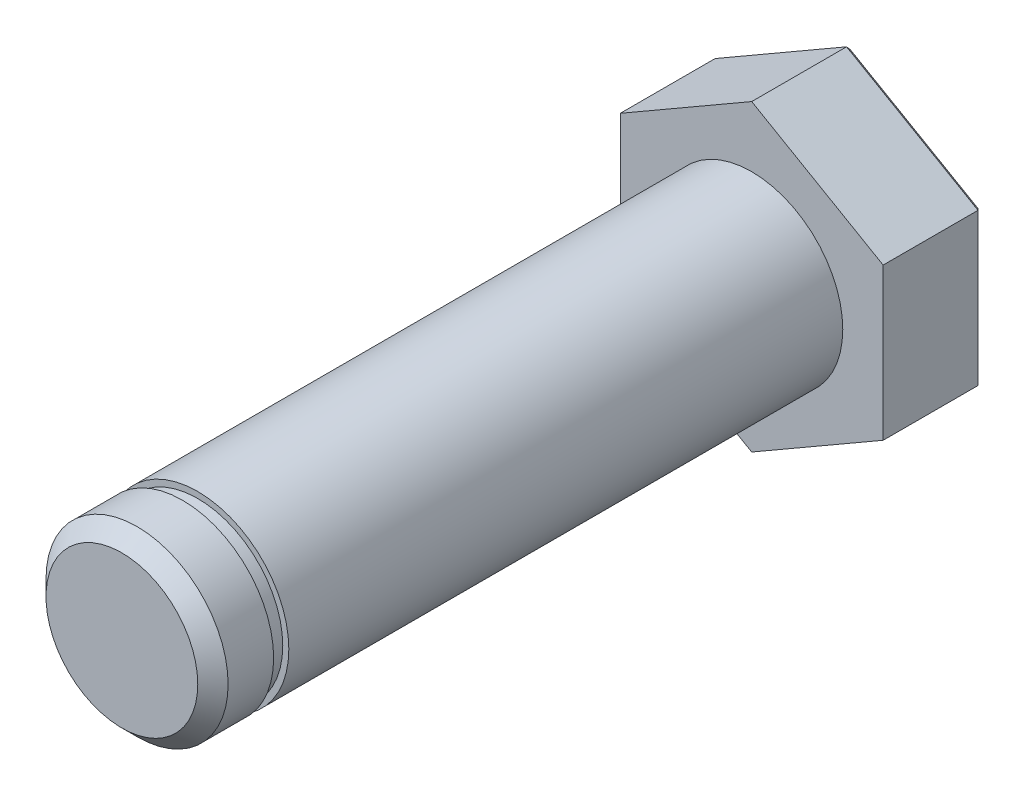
ISO-10303-21;
HEADER;
FILE_DESCRIPTION(('STEP AP214'),'2;1');
FILE_NAME('part.step','',(''),(''),'','','');
FILE_SCHEMA(('AUTOMOTIVE_DESIGN { 1 0 10303 214 1 1 1 1 }'));
ENDSEC;
DATA;
#1=APPLICATION_CONTEXT('core data for automotive mechanical design processes');
#2=APPLICATION_PROTOCOL_DEFINITION('international standard','automotive_design',2000,#1);
#3=PRODUCT_CONTEXT('',#1,'mechanical');
#4=PRODUCT('Part','Part','',(#3));
#5=PRODUCT_RELATED_PRODUCT_CATEGORY('part','',(#4));
#6=PRODUCT_DEFINITION_FORMATION('','',#4);
#7=PRODUCT_DEFINITION_CONTEXT('part definition',#1,'design');
#8=PRODUCT_DEFINITION('design','',#6,#7);
#9=PRODUCT_DEFINITION_SHAPE('','',#8);
#10=(LENGTH_UNIT() NAMED_UNIT(*) SI_UNIT(.MILLI.,.METRE.));
#11=(NAMED_UNIT(*) PLANE_ANGLE_UNIT() SI_UNIT($,.RADIAN.));
#12=(NAMED_UNIT(*) SI_UNIT($,.STERADIAN.) SOLID_ANGLE_UNIT());
#13=UNCERTAINTY_MEASURE_WITH_UNIT(LENGTH_MEASURE(1.E-05),#10,'distance_accuracy_value','');
#14=(GEOMETRIC_REPRESENTATION_CONTEXT(3) GLOBAL_UNCERTAINTY_ASSIGNED_CONTEXT((#13)) GLOBAL_UNIT_ASSIGNED_CONTEXT((#10,
#11,#12)) REPRESENTATION_CONTEXT('',''));
#15=CARTESIAN_POINT('',(0.,0.,0.));
#16=DIRECTION('',(0.,0.,1.));
#17=DIRECTION('',(1.,0.,0.));
#18=AXIS2_PLACEMENT_3D('',#15,#16,#17);
#19=CARTESIAN_POINT('',(0.,0.,36.5));
#20=DIRECTION('',(0.,0.,1.));
#21=DIRECTION('',(1.,0.,0.));
#22=AXIS2_PLACEMENT_3D('',#19,#20,#21);
#23=PLANE('',#22);
#24=CARTESIAN_POINT('',(0.,0.,36.5));
#25=DIRECTION('',(0.,0.,1.));
#26=DIRECTION('',(1.,0.,0.));
#27=AXIS2_PLACEMENT_3D('',#24,#25,#26);
#28=CIRCLE('',#27,6.);
#29=CARTESIAN_POINT('',(6.,0.,36.5));
#30=VERTEX_POINT('',#29);
#31=EDGE_CURVE('E161',#30,#30,#28,.T.);
#32=ORIENTED_EDGE('',*,*,#31,.T.);
#33=EDGE_LOOP('',(#32));
#34=FACE_BOUND('',#33,.T.);
#35=CARTESIAN_POINT('',(0.,0.,36.5));
#36=DIRECTION('',(0.,0.,1.));
#37=DIRECTION('',(1.,0.,0.));
#38=AXIS2_PLACEMENT_3D('',#35,#36,#37);
#39=CIRCLE('',#38,5.6);
#40=CARTESIAN_POINT('',(5.6,0.,36.5));
#41=VERTEX_POINT('',#40);
#42=EDGE_CURVE('E138',#41,#41,#39,.T.);
#43=ORIENTED_EDGE('',*,*,#42,.F.);
#44=EDGE_LOOP('',(#43));
#45=FACE_BOUND('',#44,.T.);
#46=ADVANCED_FACE('F35',(#34,#45),#23,.T.);
#47=CARTESIAN_POINT('',(0.,0.,36.5));
#48=DIRECTION('',(0.,0.,-1.));
#49=DIRECTION('',(-1.,0.,0.));
#50=AXIS2_PLACEMENT_3D('',#47,#48,#49);
#51=CYLINDRICAL_SURFACE('',#50,6.);
#52=ORIENTED_EDGE('',*,*,#31,.F.);
#53=EDGE_LOOP('',(#52));
#54=FACE_BOUND('',#53,.T.);
#55=CARTESIAN_POINT('',(0.,0.,0.));
#56=DIRECTION('',(0.,0.,-1.));
#57=DIRECTION('',(-1.,0.,0.));
#58=AXIS2_PLACEMENT_3D('',#55,#56,#57);
#59=CIRCLE('',#58,6.);
#60=CARTESIAN_POINT('',(-6.,0.,0.));
#61=VERTEX_POINT('',#60);
#62=EDGE_CURVE('E118',#61,#61,#59,.T.);
#63=ORIENTED_EDGE('',*,*,#62,.F.);
#64=EDGE_LOOP('',(#63));
#65=FACE_BOUND('',#64,.T.);
#66=ADVANCED_FACE('F37',(#54,#65),#51,.T.);
#67=CARTESIAN_POINT('',(-8.66025403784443,-15.,0.));
#68=DIRECTION('',(0.,0.,-1.));
#69=DIRECTION('',(-1.,0.,0.));
#70=AXIS2_PLACEMENT_3D('',#67,#68,#69);
#71=PLANE('',#70);
#72=DIRECTION('',(-0.866025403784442,-0.499999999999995,0.));
#73=VECTOR('',#72,1.);
#74=CARTESIAN_POINT('',(8.66025403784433,-5.0000000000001,0.));
#75=LINE('',#74,#73);
#76=CARTESIAN_POINT('',(8.66025403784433,-5.0000000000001,0.));
#77=VERTEX_POINT('',#76);
#78=CARTESIAN_POINT('',(0.,-10.,0.));
#79=VERTEX_POINT('',#78);
#80=EDGE_CURVE('E126',#77,#79,#75,.T.);
#81=ORIENTED_EDGE('',*,*,#80,.F.);
#82=DIRECTION('',(0.,-1.,0.));
#83=VECTOR('',#82,1.);
#84=CARTESIAN_POINT('',(8.66025403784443,4.99999999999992,0.));
#85=LINE('',#84,#83);
#86=CARTESIAN_POINT('',(8.66025403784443,4.99999999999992,0.));
#87=VERTEX_POINT('',#86);
#88=EDGE_CURVE('E149',#87,#77,#85,.T.);
#89=ORIENTED_EDGE('',*,*,#88,.F.);
#90=DIRECTION('',(0.866025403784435,-0.500000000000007,0.));
#91=VECTOR('',#90,1.);
#92=CARTESIAN_POINT('',(0.,10.,0.));
#93=LINE('',#92,#91);
#94=CARTESIAN_POINT('',(0.,10.,0.));
#95=VERTEX_POINT('',#94);
#96=EDGE_CURVE('E146',#95,#87,#93,.T.);
#97=ORIENTED_EDGE('',*,*,#96,.F.);
#98=DIRECTION('',(0.866025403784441,0.499999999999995,0.));
#99=VECTOR('',#98,1.);
#100=CARTESIAN_POINT('',(-8.66025403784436,5.00000000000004,0.));
#101=LINE('',#100,#99);
#102=CARTESIAN_POINT('',(-8.66025403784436,5.00000000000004,0.));
#103=VERTEX_POINT('',#102);
#104=EDGE_CURVE('E143',#103,#95,#101,.T.);
#105=ORIENTED_EDGE('',*,*,#104,.F.);
#106=DIRECTION('',(0.,1.,0.));
#107=VECTOR('',#106,1.);
#108=CARTESIAN_POINT('',(-8.6602540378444,-4.99999999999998,0.));
#109=LINE('',#108,#107);
#110=CARTESIAN_POINT('',(-8.6602540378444,-4.99999999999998,0.));
#111=VERTEX_POINT('',#110);
#112=EDGE_CURVE('E129',#111,#103,#109,.T.);
#113=ORIENTED_EDGE('',*,*,#112,.F.);
#114=DIRECTION('',(-0.866025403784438,0.500000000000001,0.));
#115=VECTOR('',#114,1.);
#116=CARTESIAN_POINT('',(0.,-10.,0.));
#117=LINE('',#116,#115);
#118=EDGE_CURVE('E113',#79,#111,#117,.T.);
#119=ORIENTED_EDGE('',*,*,#118,.F.);
#120=EDGE_LOOP('',(#81,#89,#97,#105,#113,#119));
#121=FACE_BOUND('',#120,.T.);
#122=ORIENTED_EDGE('',*,*,#62,.T.);
#123=EDGE_LOOP('',(#122));
#124=FACE_BOUND('',#123,.T.);
#125=ADVANCED_FACE('F123',(#121,#124),#71,.F.);
#126=CARTESIAN_POINT('',(8.66025403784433,-5.0000000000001,-6.5));
#127=DIRECTION('',(-0.499999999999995,0.866025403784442,0.));
#128=DIRECTION('',(-0.866025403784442,-0.499999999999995,0.));
#129=AXIS2_PLACEMENT_3D('',#126,#127,#128);
#130=PLANE('',#129);
#131=DIRECTION('',(0.,0.,1.));
#132=VECTOR('',#131,1.);
#133=CARTESIAN_POINT('',(0.,-10.,-6.5));
#134=LINE('',#133,#132);
#135=CARTESIAN_POINT('',(0.,-10.,-6.25));
#136=VERTEX_POINT('',#135);
#137=EDGE_CURVE('E109',#136,#79,#134,.T.);
#138=ORIENTED_EDGE('',*,*,#137,.F.);
#139=DIRECTION('',(0.866025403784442,0.499999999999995,0.));
#140=VECTOR('',#139,1.);
#141=CARTESIAN_POINT('',(8.41025403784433,-5.14433756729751,-6.25));
#142=LINE('',#141,#140);
#143=CARTESIAN_POINT('',(8.66025403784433,-5.0000000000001,-6.25));
#144=VERTEX_POINT('',#143);
#145=EDGE_CURVE('E193',#136,#144,#142,.T.);
#146=ORIENTED_EDGE('',*,*,#145,.T.);
#147=DIRECTION('',(0.,0.,1.));
#148=VECTOR('',#147,1.);
#149=CARTESIAN_POINT('',(8.66025403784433,-5.0000000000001,-6.5));
#150=LINE('',#149,#148);
#151=EDGE_CURVE('E133',#144,#77,#150,.T.);
#152=ORIENTED_EDGE('',*,*,#151,.T.);
#153=ORIENTED_EDGE('',*,*,#80,.T.);
#154=EDGE_LOOP('',(#138,#146,#152,#153));
#155=FACE_BOUND('',#154,.T.);
#156=ADVANCED_FACE('F131',(#155),#130,.F.);
#157=CARTESIAN_POINT('',(0.,-10.,-6.5));
#158=DIRECTION('',(0.500000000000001,0.866025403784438,0.));
#159=DIRECTION('',(-0.866025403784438,0.500000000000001,0.));
#160=AXIS2_PLACEMENT_3D('',#157,#158,#159);
#161=PLANE('',#160);
#162=DIRECTION('',(0.,0.,1.));
#163=VECTOR('',#162,1.);
#164=CARTESIAN_POINT('',(-8.6602540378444,-4.99999999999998,-6.5));
#165=LINE('',#164,#163);
#166=CARTESIAN_POINT('',(-8.6602540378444,-4.99999999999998,-6.25));
#167=VERTEX_POINT('',#166);
#168=EDGE_CURVE('E119',#167,#111,#165,.T.);
#169=ORIENTED_EDGE('',*,*,#168,.F.);
#170=DIRECTION('',(0.866025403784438,-0.500000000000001,0.));
#171=VECTOR('',#170,1.);
#172=CARTESIAN_POINT('',(-0.249999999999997,-9.8556624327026,-6.25));
#173=LINE('',#172,#171);
#174=EDGE_CURVE('E115',#167,#136,#173,.T.);
#175=ORIENTED_EDGE('',*,*,#174,.T.);
#176=ORIENTED_EDGE('',*,*,#137,.T.);
#177=ORIENTED_EDGE('',*,*,#118,.T.);
#178=EDGE_LOOP('',(#169,#175,#176,#177));
#179=FACE_BOUND('',#178,.T.);
#180=ADVANCED_FACE('F112',(#179),#161,.F.);
#181=CARTESIAN_POINT('',(-8.6602540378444,-4.99999999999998,-6.5));
#182=DIRECTION('',(1.,0.,0.));
#183=DIRECTION('',(0.,1.,0.));
#184=AXIS2_PLACEMENT_3D('',#181,#182,#183);
#185=PLANE('',#184);
#186=DIRECTION('',(0.,0.,1.));
#187=VECTOR('',#186,1.);
#188=CARTESIAN_POINT('',(-8.66025403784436,5.00000000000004,-6.5));
#189=LINE('',#188,#187);
#190=CARTESIAN_POINT('',(-8.66025403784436,5.00000000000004,-6.25));
#191=VERTEX_POINT('',#190);
#192=EDGE_CURVE('E156',#191,#103,#189,.T.);
#193=ORIENTED_EDGE('',*,*,#192,.F.);
#194=DIRECTION('',(0.,-1.,0.));
#195=VECTOR('',#194,1.);
#196=CARTESIAN_POINT('',(-8.6602540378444,-4.99999999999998,-6.25));
#197=LINE('',#196,#195);
#198=EDGE_CURVE('E181',#191,#167,#197,.T.);
#199=ORIENTED_EDGE('',*,*,#198,.T.);
#200=ORIENTED_EDGE('',*,*,#168,.T.);
#201=ORIENTED_EDGE('',*,*,#112,.T.);
#202=EDGE_LOOP('',(#193,#199,#200,#201));
#203=FACE_BOUND('',#202,.T.);
#204=ADVANCED_FACE('F229',(#203),#185,.F.);
#205=CARTESIAN_POINT('',(-8.66025403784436,5.00000000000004,-6.5));
#206=DIRECTION('',(0.499999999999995,-0.866025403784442,0.));
#207=DIRECTION('',(0.866025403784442,0.499999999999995,0.));
#208=AXIS2_PLACEMENT_3D('',#205,#206,#207);
#209=PLANE('',#208);
#210=DIRECTION('',(0.,0.,1.));
#211=VECTOR('',#210,1.);
#212=CARTESIAN_POINT('',(0.,10.,-6.5));
#213=LINE('',#212,#211);
#214=CARTESIAN_POINT('',(0.,10.,-6.25));
#215=VERTEX_POINT('',#214);
#216=EDGE_CURVE('E154',#215,#95,#213,.T.);
#217=ORIENTED_EDGE('',*,*,#216,.F.);
#218=DIRECTION('',(-0.866025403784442,-0.499999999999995,0.));
#219=VECTOR('',#218,1.);
#220=CARTESIAN_POINT('',(-8.66025403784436,5.00000000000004,-6.25));
#221=LINE('',#220,#219);
#222=EDGE_CURVE('E174',#215,#191,#221,.T.);
#223=ORIENTED_EDGE('',*,*,#222,.T.);
#224=ORIENTED_EDGE('',*,*,#192,.T.);
#225=ORIENTED_EDGE('',*,*,#104,.T.);
#226=EDGE_LOOP('',(#217,#223,#224,#225));
#227=FACE_BOUND('',#226,.T.);
#228=ADVANCED_FACE('F232',(#227),#209,.F.);
#229=CARTESIAN_POINT('',(0.,10.,-6.5));
#230=DIRECTION('',(-0.500000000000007,-0.866025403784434,0.));
#231=DIRECTION('',(0.866025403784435,-0.500000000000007,0.));
#232=AXIS2_PLACEMENT_3D('',#229,#230,#231);
#233=PLANE('',#232);
#234=DIRECTION('',(0.,0.,1.));
#235=VECTOR('',#234,1.);
#236=CARTESIAN_POINT('',(8.66025403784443,4.99999999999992,-6.5));
#237=LINE('',#236,#235);
#238=CARTESIAN_POINT('',(8.66025403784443,4.99999999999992,-6.25));
#239=VERTEX_POINT('',#238);
#240=EDGE_CURVE('E152',#239,#87,#237,.T.);
#241=ORIENTED_EDGE('',*,*,#240,.F.);
#242=DIRECTION('',(-0.866025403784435,0.500000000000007,0.));
#243=VECTOR('',#242,1.);
#244=CARTESIAN_POINT('',(0.,10.,-6.25));
#245=LINE('',#244,#243);
#246=EDGE_CURVE('E167',#239,#215,#245,.T.);
#247=ORIENTED_EDGE('',*,*,#246,.T.);
#248=ORIENTED_EDGE('',*,*,#216,.T.);
#249=ORIENTED_EDGE('',*,*,#96,.T.);
#250=EDGE_LOOP('',(#241,#247,#248,#249));
#251=FACE_BOUND('',#250,.T.);
#252=ADVANCED_FACE('F236',(#251),#233,.F.);
#253=CARTESIAN_POINT('',(8.66025403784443,4.99999999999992,-6.5));
#254=DIRECTION('',(-1.,0.,0.));
#255=DIRECTION('',(0.,-1.,0.));
#256=AXIS2_PLACEMENT_3D('',#253,#254,#255);
#257=PLANE('',#256);
#258=ORIENTED_EDGE('',*,*,#151,.F.);
#259=DIRECTION('',(0.,1.,0.));
#260=VECTOR('',#259,1.);
#261=CARTESIAN_POINT('',(8.66025403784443,4.71132486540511,-6.25));
#262=LINE('',#261,#260);
#263=EDGE_CURVE('E187',#144,#239,#262,.T.);
#264=ORIENTED_EDGE('',*,*,#263,.T.);
#265=ORIENTED_EDGE('',*,*,#240,.T.);
#266=ORIENTED_EDGE('',*,*,#88,.T.);
#267=EDGE_LOOP('',(#258,#264,#265,#266));
#268=FACE_BOUND('',#267,.T.);
#269=ADVANCED_FACE('F240',(#268),#257,.F.);
#270=CARTESIAN_POINT('',(-8.66025403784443,-15.,-6.5));
#271=DIRECTION('',(0.,0.,-1.));
#272=DIRECTION('',(-1.,0.,0.));
#273=AXIS2_PLACEMENT_3D('',#270,#271,#272);
#274=PLANE('',#273);
#275=DIRECTION('',(-0.866025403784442,-0.499999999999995,0.));
#276=VECTOR('',#275,1.);
#277=CARTESIAN_POINT('',(-0.124999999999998,-9.78349364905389,-6.5));
#278=LINE('',#277,#276);
#279=CARTESIAN_POINT('',(8.41025403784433,-4.85566243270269,-6.5));
#280=VERTEX_POINT('',#279);
#281=CARTESIAN_POINT('',(0.,-9.71132486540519,-6.5));
#282=VERTEX_POINT('',#281);
#283=EDGE_CURVE('E191',#280,#282,#278,.T.);
#284=ORIENTED_EDGE('',*,*,#283,.T.);
#285=DIRECTION('',(-0.866025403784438,0.500000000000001,0.));
#286=VECTOR('',#285,1.);
#287=CARTESIAN_POINT('',(-8.2852540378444,-4.92783121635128,-6.5));
#288=LINE('',#287,#286);
#289=CARTESIAN_POINT('',(-8.4102540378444,-4.85566243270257,-6.5));
#290=VERTEX_POINT('',#289);
#291=EDGE_CURVE('E197',#282,#290,#288,.T.);
#292=ORIENTED_EDGE('',*,*,#291,.T.);
#293=DIRECTION('',(0.,1.,0.));
#294=VECTOR('',#293,1.);
#295=CARTESIAN_POINT('',(-8.41025403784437,4.71132486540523,-6.5));
#296=LINE('',#295,#294);
#297=CARTESIAN_POINT('',(-8.41025403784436,4.85566243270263,-6.5));
#298=VERTEX_POINT('',#297);
#299=EDGE_CURVE('E177',#290,#298,#296,.T.);
#300=ORIENTED_EDGE('',*,*,#299,.T.);
#301=DIRECTION('',(0.866025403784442,0.499999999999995,0.));
#302=VECTOR('',#301,1.);
#303=CARTESIAN_POINT('',(-0.124999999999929,9.63915608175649,-6.5));
#304=LINE('',#303,#302);
#305=CARTESIAN_POINT('',(0.,9.71132486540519,-6.5));
#306=VERTEX_POINT('',#305);
#307=EDGE_CURVE('E170',#298,#306,#304,.T.);
#308=ORIENTED_EDGE('',*,*,#307,.T.);
#309=DIRECTION('',(0.866025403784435,-0.500000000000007,0.));
#310=VECTOR('',#309,1.);
#311=CARTESIAN_POINT('',(8.53525403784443,4.78349364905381,-6.5));
#312=LINE('',#311,#310);
#313=CARTESIAN_POINT('',(8.41025403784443,4.85566243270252,-6.5));
#314=VERTEX_POINT('',#313);
#315=EDGE_CURVE('E164',#306,#314,#312,.T.);
#316=ORIENTED_EDGE('',*,*,#315,.T.);
#317=DIRECTION('',(0.,-1.,0.));
#318=VECTOR('',#317,1.);
#319=CARTESIAN_POINT('',(8.41025403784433,-5.0000000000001,-6.5));
#320=LINE('',#319,#318);
#321=EDGE_CURVE('E184',#314,#280,#320,.T.);
#322=ORIENTED_EDGE('',*,*,#321,.T.);
#323=EDGE_LOOP('',(#284,#292,#300,#308,#316,#322));
#324=FACE_BOUND('',#323,.T.);
#325=ADVANCED_FACE('F244',(#324),#274,.T.);
#326=CARTESIAN_POINT('',(4.20512701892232,7.28349364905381,-6.5));
#327=DIRECTION('',(0.35355339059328,0.612372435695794,-0.707106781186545));
#328=DIRECTION('',(0.,0.755928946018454,0.654653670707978));
#329=AXIS2_PLACEMENT_3D('',#326,#327,#328);
#330=PLANE('',#329);
#331=ORIENTED_EDGE('',*,*,#246,.F.);
#332=DIRECTION('',(-0.654653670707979,-0.37796447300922,-0.654653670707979));
#333=VECTOR('',#332,1.);
#334=CARTESIAN_POINT('',(7.20878917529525,4.16199637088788,-7.70146486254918));
#335=LINE('',#334,#333);
#336=EDGE_CURVE('E189',#239,#314,#335,.T.);
#337=ORIENTED_EDGE('',*,*,#336,.T.);
#338=ORIENTED_EDGE('',*,*,#315,.F.);
#339=DIRECTION('',(0.,0.755928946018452,0.654653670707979));
#340=VECTOR('',#339,1.);
#341=CARTESIAN_POINT('',(0.,8.32399274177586,-7.70146486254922));
#342=LINE('',#341,#340);
#343=EDGE_CURVE('E172',#306,#215,#342,.T.);
#344=ORIENTED_EDGE('',*,*,#343,.T.);
#345=EDGE_LOOP('',(#331,#337,#338,#344));
#346=FACE_BOUND('',#345,.T.);
#347=ADVANCED_FACE('F248',(#346),#330,.T.);
#348=CARTESIAN_POINT('',(-17.1955080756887,-0.216506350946,-6.5));
#349=DIRECTION('',(-0.353553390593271,0.612372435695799,-0.707106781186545));
#350=DIRECTION('',(0.,0.755928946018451,0.654653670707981));
#351=AXIS2_PLACEMENT_3D('',#348,#349,#350);
#352=PLANE('',#351);
#353=ORIENTED_EDGE('',*,*,#307,.F.);
#354=DIRECTION('',(-0.654653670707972,0.377964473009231,0.65465367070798));
#355=VECTOR('',#354,1.);
#356=CARTESIAN_POINT('',(-10.9203266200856,6.30485351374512,-3.98992741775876));
#357=LINE('',#356,#355);
#358=EDGE_CURVE('E179',#298,#191,#357,.T.);
#359=ORIENTED_EDGE('',*,*,#358,.T.);
#360=ORIENTED_EDGE('',*,*,#222,.F.);
#361=ORIENTED_EDGE('',*,*,#343,.F.);
#362=EDGE_LOOP('',(#353,#359,#360,#361));
#363=FACE_BOUND('',#362,.T.);
#364=ADVANCED_FACE('F254',(#363),#352,.T.);
#365=CARTESIAN_POINT('',(-8.41025403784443,-15.,-6.5));
#366=DIRECTION('',(-0.707106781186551,0.,-0.707106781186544));
#367=DIRECTION('',(-0.707106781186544,0.,0.707106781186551));
#368=AXIS2_PLACEMENT_3D('',#365,#366,#367);
#369=PLANE('',#368);
#370=ORIENTED_EDGE('',*,*,#299,.F.);
#371=DIRECTION('',(-0.654653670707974,-0.377964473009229,0.65465367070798));
#372=VECTOR('',#371,1.);
#373=CARTESIAN_POINT('',(-10.9203266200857,-6.30485351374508,-3.98992741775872));
#374=LINE('',#373,#372);
#375=EDGE_CURVE('E50',#290,#167,#374,.T.);
#376=ORIENTED_EDGE('',*,*,#375,.T.);
#377=ORIENTED_EDGE('',*,*,#198,.F.);
#378=ORIENTED_EDGE('',*,*,#358,.F.);
#379=EDGE_LOOP('',(#370,#376,#377,#378));
#380=FACE_BOUND('',#379,.T.);
#381=ADVANCED_FACE('F258',(#380),#369,.T.);
#382=CARTESIAN_POINT('',(8.41025403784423,-15.0000000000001,-6.5));
#383=DIRECTION('',(0.70710678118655,0.,-0.707106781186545));
#384=DIRECTION('',(-0.707106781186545,0.,-0.70710678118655));
#385=AXIS2_PLACEMENT_3D('',#382,#383,#384);
#386=PLANE('',#385);
#387=ORIENTED_EDGE('',*,*,#263,.F.);
#388=DIRECTION('',(-0.654653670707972,0.377964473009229,-0.654653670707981));
#389=VECTOR('',#388,1.);
#390=CARTESIAN_POINT('',(10.9203266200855,-6.30485351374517,-3.98992741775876));
#391=LINE('',#390,#389);
#392=EDGE_CURVE('E195',#144,#280,#391,.T.);
#393=ORIENTED_EDGE('',*,*,#392,.T.);
#394=ORIENTED_EDGE('',*,*,#321,.F.);
#395=ORIENTED_EDGE('',*,*,#336,.F.);
#396=EDGE_LOOP('',(#387,#393,#394,#395));
#397=FACE_BOUND('',#396,.T.);
#398=ADVANCED_FACE('F262',(#397),#386,.T.);
#399=CARTESIAN_POINT('',(-8.78525403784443,-14.7834936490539,-6.5));
#400=DIRECTION('',(0.353553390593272,-0.6123724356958,-0.707106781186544));
#401=DIRECTION('',(0.,0.75592894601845,-0.654653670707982));
#402=AXIS2_PLACEMENT_3D('',#399,#400,#401);
#403=PLANE('',#402);
#404=ORIENTED_EDGE('',*,*,#145,.F.);
#405=DIRECTION('',(0.,0.755928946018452,-0.65465367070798));
#406=VECTOR('',#405,1.);
#407=CARTESIAN_POINT('',(0.,-12.6097070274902,-3.98992741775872));
#408=LINE('',#407,#406);
#409=EDGE_CURVE('E58',#136,#282,#408,.T.);
#410=ORIENTED_EDGE('',*,*,#409,.T.);
#411=ORIENTED_EDGE('',*,*,#283,.F.);
#412=ORIENTED_EDGE('',*,*,#392,.F.);
#413=EDGE_LOOP('',(#404,#410,#411,#412));
#414=FACE_BOUND('',#413,.T.);
#415=ADVANCED_FACE('F266',(#414),#403,.T.);
#416=CARTESIAN_POINT('',(-4.20512701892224,-7.28349364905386,-6.5));
#417=DIRECTION('',(-0.353553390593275,-0.612372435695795,-0.707106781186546));
#418=DIRECTION('',(0.,0.755928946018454,-0.654653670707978));
#419=AXIS2_PLACEMENT_3D('',#416,#417,#418);
#420=PLANE('',#419);
#421=ORIENTED_EDGE('',*,*,#409,.F.);
#422=ORIENTED_EDGE('',*,*,#174,.F.);
#423=ORIENTED_EDGE('',*,*,#375,.F.);
#424=ORIENTED_EDGE('',*,*,#291,.F.);
#425=EDGE_LOOP('',(#421,#422,#423,#424));
#426=FACE_BOUND('',#425,.T.);
#427=ADVANCED_FACE('F270',(#426),#420,.T.);
#428=CARTESIAN_POINT('',(0.,0.,37.5));
#429=DIRECTION('',(0.,0.,-1.));
#430=DIRECTION('',(-1.,0.,0.));
#431=AXIS2_PLACEMENT_3D('',#428,#429,#430);
#432=CYLINDRICAL_SURFACE('',#431,5.6);
#433=CARTESIAN_POINT('',(0.,0.,37.5));
#434=DIRECTION('',(0.,0.,1.));
#435=DIRECTION('',(1.,0.,0.));
#436=AXIS2_PLACEMENT_3D('',#433,#434,#435);
#437=CIRCLE('',#436,5.6);
#438=CARTESIAN_POINT('',(5.6,0.,37.5));
#439=VERTEX_POINT('',#438);
#440=EDGE_CURVE('E135',#439,#439,#437,.T.);
#441=ORIENTED_EDGE('',*,*,#440,.F.);
#442=EDGE_LOOP('',(#441));
#443=FACE_BOUND('',#442,.T.);
#444=ORIENTED_EDGE('',*,*,#42,.T.);
#445=EDGE_LOOP('',(#444));
#446=FACE_BOUND('',#445,.T.);
#447=ADVANCED_FACE('F273',(#443,#446),#432,.T.);
#448=CARTESIAN_POINT('',(0.,0.,37.5));
#449=DIRECTION('',(0.,0.,1.));
#450=DIRECTION('',(1.,0.,0.));
#451=AXIS2_PLACEMENT_3D('',#448,#449,#450);
#452=PLANE('',#451);
#453=CARTESIAN_POINT('',(0.,0.,37.5));
#454=DIRECTION('',(0.,0.,1.));
#455=DIRECTION('',(1.,0.,0.));
#456=AXIS2_PLACEMENT_3D('',#453,#454,#455);
#457=CIRCLE('',#456,6.);
#458=CARTESIAN_POINT('',(6.,0.,37.5));
#459=VERTEX_POINT('',#458);
#460=EDGE_CURVE('E287',#459,#459,#457,.T.);
#461=ORIENTED_EDGE('',*,*,#460,.F.);
#462=EDGE_LOOP('',(#461));
#463=FACE_BOUND('',#462,.T.);
#464=ORIENTED_EDGE('',*,*,#440,.T.);
#465=EDGE_LOOP('',(#464));
#466=FACE_BOUND('',#465,.T.);
#467=ADVANCED_FACE('F276',(#463,#466),#452,.F.);
#468=CARTESIAN_POINT('',(0.,0.,41.5));
#469=DIRECTION('',(0.,0.,-1.));
#470=DIRECTION('',(-1.,0.,0.));
#471=AXIS2_PLACEMENT_3D('',#468,#469,#470);
#472=CYLINDRICAL_SURFACE('',#471,6.);
#473=CARTESIAN_POINT('',(0.,0.,40.5));
#474=DIRECTION('',(0.,0.,1.));
#475=DIRECTION('',(1.,0.,0.));
#476=AXIS2_PLACEMENT_3D('',#473,#474,#475);
#477=CIRCLE('',#476,6.);
#478=CARTESIAN_POINT('',(6.,0.,40.5));
#479=VERTEX_POINT('',#478);
#480=EDGE_CURVE('E11',#479,#479,#477,.F.);
#481=ORIENTED_EDGE('',*,*,#480,.T.);
#482=EDGE_LOOP('',(#481));
#483=FACE_BOUND('',#482,.T.);
#484=ORIENTED_EDGE('',*,*,#460,.T.);
#485=EDGE_LOOP('',(#484));
#486=FACE_BOUND('',#485,.T.);
#487=ADVANCED_FACE('F213',(#483,#486),#472,.T.);
#488=CARTESIAN_POINT('',(0.,0.,41.5));
#489=DIRECTION('',(0.,0.,1.));
#490=DIRECTION('',(1.,0.,0.));
#491=AXIS2_PLACEMENT_3D('',#488,#489,#490);
#492=PLANE('',#491);
#493=CARTESIAN_POINT('',(0.,0.,41.5));
#494=DIRECTION('',(0.,0.,1.));
#495=DIRECTION('',(1.,0.,0.));
#496=AXIS2_PLACEMENT_3D('',#493,#494,#495);
#497=CIRCLE('',#496,4.99999999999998);
#498=CARTESIAN_POINT('',(4.99999999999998,0.,41.5));
#499=VERTEX_POINT('',#498);
#500=EDGE_CURVE('E43',#499,#499,#497,.T.);
#501=ORIENTED_EDGE('',*,*,#500,.T.);
#502=EDGE_LOOP('',(#501));
#503=FACE_BOUND('',#502,.T.);
#504=ADVANCED_FACE('F204',(#503),#492,.T.);
#505=CARTESIAN_POINT('',(0.,0.,41.5));
#506=DIRECTION('',(0.,0.,-1.));
#507=DIRECTION('',(-1.,0.,0.));
#508=AXIS2_PLACEMENT_3D('',#505,#506,#507);
#509=CONICAL_SURFACE('',#508,4.99999999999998,0.785398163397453);
#510=ORIENTED_EDGE('',*,*,#480,.F.);
#511=EDGE_LOOP('',(#510));
#512=FACE_BOUND('',#511,.T.);
#513=ORIENTED_EDGE('',*,*,#500,.F.);
#514=EDGE_LOOP('',(#513));
#515=FACE_BOUND('',#514,.T.);
#516=ADVANCED_FACE('F206',(#512,#515),#509,.T.);
#517=CLOSED_SHELL('',(#46,#66,#125,#156,#180,#204,#228,#252,#269,#325,#347,#364,#381,#398,#415,
#427,#447,#467,#487,#504,#516));
#518=MANIFOLD_SOLID_BREP('B2',#517);
#519=ADVANCED_BREP_SHAPE_REPRESENTATION('',(#18,#518),#14);
#520=SHAPE_DEFINITION_REPRESENTATION(#9,#519);
ENDSEC;
END-ISO-10303-21;
